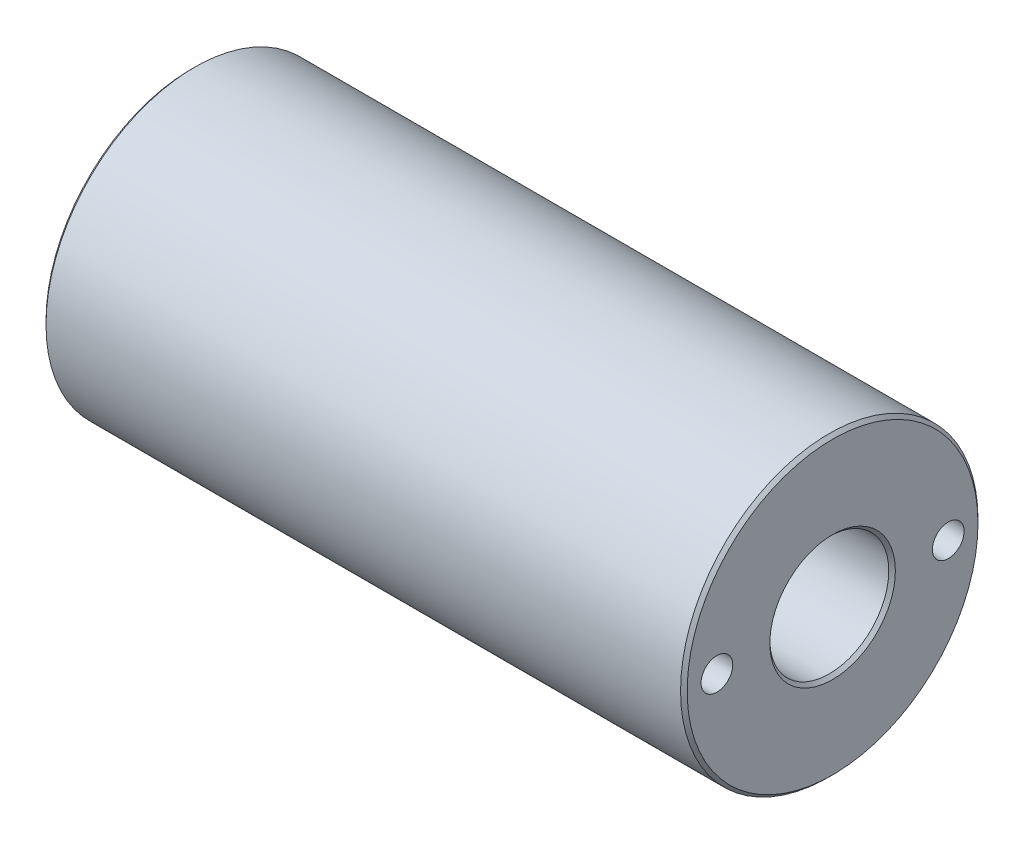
ISO-10303-21;
HEADER;
FILE_DESCRIPTION(('STEP AP214'),'2;1');
FILE_NAME('part.step','',(''),(''),'','','');
FILE_SCHEMA(('AUTOMOTIVE_DESIGN { 1 0 10303 214 1 1 1 1 }'));
ENDSEC;
DATA;
#1=APPLICATION_CONTEXT('core data for automotive mechanical design processes');
#2=APPLICATION_PROTOCOL_DEFINITION('international standard','automotive_design',2000,#1);
#3=PRODUCT_CONTEXT('',#1,'mechanical');
#4=PRODUCT('Part','Part','',(#3));
#5=PRODUCT_RELATED_PRODUCT_CATEGORY('part','',(#4));
#6=PRODUCT_DEFINITION_FORMATION('','',#4);
#7=PRODUCT_DEFINITION_CONTEXT('part definition',#1,'design');
#8=PRODUCT_DEFINITION('design','',#6,#7);
#9=PRODUCT_DEFINITION_SHAPE('','',#8);
#10=(LENGTH_UNIT() NAMED_UNIT(*) SI_UNIT(.MILLI.,.METRE.));
#11=(NAMED_UNIT(*) PLANE_ANGLE_UNIT() SI_UNIT($,.RADIAN.));
#12=(NAMED_UNIT(*) SI_UNIT($,.STERADIAN.) SOLID_ANGLE_UNIT());
#13=UNCERTAINTY_MEASURE_WITH_UNIT(LENGTH_MEASURE(1.E-05),#10,'distance_accuracy_value','');
#14=(GEOMETRIC_REPRESENTATION_CONTEXT(3) GLOBAL_UNCERTAINTY_ASSIGNED_CONTEXT((#13)) GLOBAL_UNIT_ASSIGNED_CONTEXT((#10,
#11,#12)) REPRESENTATION_CONTEXT('',''));
#15=CARTESIAN_POINT('',(0.,0.,0.));
#16=DIRECTION('',(0.,0.,1.));
#17=DIRECTION('',(1.,0.,0.));
#18=AXIS2_PLACEMENT_3D('',#15,#16,#17);
#19=CARTESIAN_POINT('',(446.537407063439,0.,0.));
#20=DIRECTION('',(1.,0.,0.));
#21=DIRECTION('',(0.,0.,-1.));
#22=AXIS2_PLACEMENT_3D('',#19,#20,#21);
#23=CYLINDRICAL_SURFACE('',#22,6.99999999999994);
#24=CARTESIAN_POINT('',(-17.5,0.,0.));
#25=DIRECTION('',(1.,0.,0.));
#26=DIRECTION('',(0.,0.,-1.));
#27=AXIS2_PLACEMENT_3D('',#24,#25,#26);
#28=CIRCLE('',#27,6.99999999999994);
#29=CARTESIAN_POINT('',(-17.5,0.,-6.99999999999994));
#30=VERTEX_POINT('',#29);
#31=EDGE_CURVE('E91',#30,#30,#28,.T.);
#32=ORIENTED_EDGE('',*,*,#31,.T.);
#33=EDGE_LOOP('',(#32));
#34=FACE_BOUND('',#33,.T.);
#35=CARTESIAN_POINT('',(-79.5,0.,0.));
#36=DIRECTION('',(-1.,0.,0.));
#37=DIRECTION('',(0.,0.,1.));
#38=AXIS2_PLACEMENT_3D('',#35,#36,#37);
#39=CIRCLE('',#38,6.99999999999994);
#40=CARTESIAN_POINT('',(-79.5,0.,6.99999999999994));
#41=VERTEX_POINT('',#40);
#42=EDGE_CURVE('E88',#41,#41,#39,.T.);
#43=ORIENTED_EDGE('',*,*,#42,.T.);
#44=EDGE_LOOP('',(#43));
#45=FACE_BOUND('',#44,.T.);
#46=ADVANCED_FACE('F30',(#34,#45),#23,.F.);
#47=CARTESIAN_POINT('',(-97.,6.99999999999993,0.));
#48=DIRECTION('',(-1.,0.,0.));
#49=DIRECTION('',(0.,0.,1.));
#50=AXIS2_PLACEMENT_3D('',#47,#48,#49);
#51=PLANE('',#50);
#52=CARTESIAN_POINT('',(-97.,0.,0.));
#53=DIRECTION('',(-1.,0.,0.));
#54=DIRECTION('',(0.,0.,1.));
#55=AXIS2_PLACEMENT_3D('',#52,#53,#54);
#56=CIRCLE('',#55,9.5);
#57=CARTESIAN_POINT('',(-97.,0.,9.5));
#58=VERTEX_POINT('',#57);
#59=EDGE_CURVE('E11',#58,#58,#56,.F.);
#60=ORIENTED_EDGE('',*,*,#59,.T.);
#61=EDGE_LOOP('',(#60));
#62=FACE_BOUND('',#61,.T.);
#63=CARTESIAN_POINT('',(-97.,0.,0.));
#64=DIRECTION('',(-1.,0.,0.));
#65=DIRECTION('',(0.,0.,1.));
#66=AXIS2_PLACEMENT_3D('',#63,#64,#65);
#67=CIRCLE('',#66,22.);
#68=CARTESIAN_POINT('',(-97.,0.,22.));
#69=VERTEX_POINT('',#68);
#70=EDGE_CURVE('E76',#69,#69,#67,.T.);
#71=ORIENTED_EDGE('',*,*,#70,.T.);
#72=EDGE_LOOP('',(#71));
#73=FACE_BOUND('',#72,.T.);
#74=ADVANCED_FACE('F32',(#62,#73),#51,.T.);
#75=CARTESIAN_POINT('',(446.537407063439,0.,0.));
#76=DIRECTION('',(1.,0.,0.));
#77=DIRECTION('',(0.,0.,-1.));
#78=AXIS2_PLACEMENT_3D('',#75,#76,#77);
#79=CYLINDRICAL_SURFACE('',#78,22.4999999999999);
#80=CARTESIAN_POINT('',(-96.5000000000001,0.,0.));
#81=DIRECTION('',(-1.,0.,0.));
#82=DIRECTION('',(0.,0.,1.));
#83=AXIS2_PLACEMENT_3D('',#80,#81,#82);
#84=CIRCLE('',#83,22.4999999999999);
#85=CARTESIAN_POINT('',(-96.5000000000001,0.,22.4999999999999));
#86=VERTEX_POINT('',#85);
#87=EDGE_CURVE('E73',#86,#86,#84,.F.);
#88=ORIENTED_EDGE('',*,*,#87,.T.);
#89=EDGE_LOOP('',(#88));
#90=FACE_BOUND('',#89,.T.);
#91=CARTESIAN_POINT('',(-0.500000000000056,0.,0.));
#92=DIRECTION('',(1.,0.,0.));
#93=DIRECTION('',(0.,0.,-1.));
#94=AXIS2_PLACEMENT_3D('',#91,#92,#93);
#95=CIRCLE('',#94,22.4999999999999);
#96=CARTESIAN_POINT('',(-0.500000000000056,0.,-22.4999999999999));
#97=VERTEX_POINT('',#96);
#98=EDGE_CURVE('E70',#97,#97,#95,.F.);
#99=ORIENTED_EDGE('',*,*,#98,.T.);
#100=EDGE_LOOP('',(#99));
#101=FACE_BOUND('',#100,.T.);
#102=ADVANCED_FACE('F123',(#90,#101),#79,.T.);
#103=CARTESIAN_POINT('',(0.,22.4999999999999,0.));
#104=DIRECTION('',(1.,0.,0.));
#105=DIRECTION('',(0.,0.,-1.));
#106=AXIS2_PLACEMENT_3D('',#103,#104,#105);
#107=PLANE('',#106);
#108=CARTESIAN_POINT('',(0.,0.,0.));
#109=DIRECTION('',(1.,0.,0.));
#110=DIRECTION('',(0.,0.,-1.));
#111=AXIS2_PLACEMENT_3D('',#108,#109,#110);
#112=CIRCLE('',#111,9.5);
#113=CARTESIAN_POINT('',(0.,0.,-9.5));
#114=VERTEX_POINT('',#113);
#115=EDGE_CURVE('E85',#114,#114,#112,.F.);
#116=ORIENTED_EDGE('',*,*,#115,.T.);
#117=EDGE_LOOP('',(#116));
#118=FACE_BOUND('',#117,.T.);
#119=CARTESIAN_POINT('',(0.,0.,17.5));
#120=DIRECTION('',(1.,0.,0.));
#121=DIRECTION('',(0.,0.,-1.));
#122=AXIS2_PLACEMENT_3D('',#119,#120,#121);
#123=CIRCLE('',#122,2.39999999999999);
#124=CARTESIAN_POINT('',(0.,0.,15.1));
#125=VERTEX_POINT('',#124);
#126=EDGE_CURVE('E54',#125,#125,#123,.T.);
#127=ORIENTED_EDGE('',*,*,#126,.F.);
#128=EDGE_LOOP('',(#127));
#129=FACE_BOUND('',#128,.T.);
#130=CARTESIAN_POINT('',(0.,0.,-17.5));
#131=DIRECTION('',(1.,0.,0.));
#132=DIRECTION('',(0.,0.,-1.));
#133=AXIS2_PLACEMENT_3D('',#130,#131,#132);
#134=CIRCLE('',#133,2.39999999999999);
#135=CARTESIAN_POINT('',(0.,0.,-19.9));
#136=VERTEX_POINT('',#135);
#137=EDGE_CURVE('E67',#136,#136,#134,.T.);
#138=ORIENTED_EDGE('',*,*,#137,.F.);
#139=EDGE_LOOP('',(#138));
#140=FACE_BOUND('',#139,.T.);
#141=CARTESIAN_POINT('',(0.,0.,0.));
#142=DIRECTION('',(1.,0.,0.));
#143=DIRECTION('',(0.,0.,-1.));
#144=AXIS2_PLACEMENT_3D('',#141,#142,#143);
#145=CIRCLE('',#144,21.9999999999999);
#146=CARTESIAN_POINT('',(0.,0.,-21.9999999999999));
#147=VERTEX_POINT('',#146);
#148=EDGE_CURVE('E79',#147,#147,#145,.T.);
#149=ORIENTED_EDGE('',*,*,#148,.T.);
#150=EDGE_LOOP('',(#149));
#151=FACE_BOUND('',#150,.T.);
#152=ADVANCED_FACE('F130',(#118,#129,#140,#151),#107,.T.);
#153=CARTESIAN_POINT('',(-96.5000000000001,0.,0.));
#154=DIRECTION('',(1.,0.,0.));
#155=DIRECTION('',(0.,0.,-1.));
#156=AXIS2_PLACEMENT_3D('',#153,#154,#155);
#157=CONICAL_SURFACE('',#156,22.4999999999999,0.785398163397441);
#158=ORIENTED_EDGE('',*,*,#70,.F.);
#159=EDGE_LOOP('',(#158));
#160=FACE_BOUND('',#159,.T.);
#161=ORIENTED_EDGE('',*,*,#87,.F.);
#162=EDGE_LOOP('',(#161));
#163=FACE_BOUND('',#162,.T.);
#164=ADVANCED_FACE('F128',(#160,#163),#157,.T.);
#165=CARTESIAN_POINT('',(0.,0.,0.));
#166=DIRECTION('',(-1.,0.,0.));
#167=DIRECTION('',(0.,0.,1.));
#168=AXIS2_PLACEMENT_3D('',#165,#166,#167);
#169=CONICAL_SURFACE('',#168,21.9999999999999,0.785398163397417);
#170=ORIENTED_EDGE('',*,*,#98,.F.);
#171=EDGE_LOOP('',(#170));
#172=FACE_BOUND('',#171,.T.);
#173=ORIENTED_EDGE('',*,*,#148,.F.);
#174=EDGE_LOOP('',(#173));
#175=FACE_BOUND('',#174,.T.);
#176=ADVANCED_FACE('F141',(#172,#175),#169,.T.);
#177=CARTESIAN_POINT('',(0.,0.,-17.5));
#178=DIRECTION('',(1.,0.,0.));
#179=DIRECTION('',(0.,0.,-1.));
#180=AXIS2_PLACEMENT_3D('',#177,#178,#179);
#181=CYLINDRICAL_SURFACE('',#180,2.39999999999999);
#182=CARTESIAN_POINT('',(-23.,0.,-17.5));
#183=DIRECTION('',(1.,0.,0.));
#184=DIRECTION('',(0.,0.,-1.));
#185=AXIS2_PLACEMENT_3D('',#182,#183,#184);
#186=CIRCLE('',#185,2.39999999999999);
#187=CARTESIAN_POINT('',(-23.,0.,-19.9));
#188=VERTEX_POINT('',#187);
#189=EDGE_CURVE('E58',#188,#188,#186,.T.);
#190=ORIENTED_EDGE('',*,*,#189,.F.);
#191=EDGE_LOOP('',(#190));
#192=FACE_BOUND('',#191,.T.);
#193=ORIENTED_EDGE('',*,*,#137,.T.);
#194=EDGE_LOOP('',(#193));
#195=FACE_BOUND('',#194,.T.);
#196=ADVANCED_FACE('F144',(#192,#195),#181,.F.);
#197=CARTESIAN_POINT('',(-23.,0.,-17.5));
#198=DIRECTION('',(1.,0.,0.));
#199=DIRECTION('',(0.,0.,-1.));
#200=AXIS2_PLACEMENT_3D('',#197,#198,#199);
#201=CONICAL_SURFACE('',#200,2.39999999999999,1.02974425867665);
#202=CARTESIAN_POINT('',(-24.4420654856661,0.,-17.5));
#203=VERTEX_POINT('',#202);
#204=VERTEX_LOOP('',#203);
#205=FACE_BOUND('',#204,.T.);
#206=ORIENTED_EDGE('',*,*,#189,.T.);
#207=EDGE_LOOP('',(#206));
#208=FACE_BOUND('',#207,.T.);
#209=ADVANCED_FACE('F151',(#205,#208),#201,.F.);
#210=CARTESIAN_POINT('',(0.,0.,17.5));
#211=DIRECTION('',(1.,0.,0.));
#212=DIRECTION('',(0.,0.,-1.));
#213=AXIS2_PLACEMENT_3D('',#210,#211,#212);
#214=CYLINDRICAL_SURFACE('',#213,2.39999999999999);
#215=CARTESIAN_POINT('',(-23.,0.,17.5));
#216=DIRECTION('',(1.,0.,0.));
#217=DIRECTION('',(0.,0.,-1.));
#218=AXIS2_PLACEMENT_3D('',#215,#216,#217);
#219=CIRCLE('',#218,2.39999999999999);
#220=CARTESIAN_POINT('',(-23.,0.,15.1));
#221=VERTEX_POINT('',#220);
#222=EDGE_CURVE('E52',#221,#221,#219,.T.);
#223=ORIENTED_EDGE('',*,*,#222,.F.);
#224=EDGE_LOOP('',(#223));
#225=FACE_BOUND('',#224,.T.);
#226=ORIENTED_EDGE('',*,*,#126,.T.);
#227=EDGE_LOOP('',(#226));
#228=FACE_BOUND('',#227,.T.);
#229=ADVANCED_FACE('F48',(#225,#228),#214,.F.);
#230=CARTESIAN_POINT('',(-23.,0.,17.5));
#231=DIRECTION('',(1.,0.,0.));
#232=DIRECTION('',(0.,0.,-1.));
#233=AXIS2_PLACEMENT_3D('',#230,#231,#232);
#234=CONICAL_SURFACE('',#233,2.39999999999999,1.02974425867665);
#235=CARTESIAN_POINT('',(-24.4420654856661,0.,17.5));
#236=VERTEX_POINT('',#235);
#237=VERTEX_LOOP('',#236);
#238=FACE_BOUND('',#237,.T.);
#239=ORIENTED_EDGE('',*,*,#222,.T.);
#240=EDGE_LOOP('',(#239));
#241=FACE_BOUND('',#240,.T.);
#242=ADVANCED_FACE('F44',(#238,#241),#234,.F.);
#243=CARTESIAN_POINT('',(-17.,0.,0.));
#244=DIRECTION('',(1.,0.,0.));
#245=DIRECTION('',(0.,0.,-1.));
#246=AXIS2_PLACEMENT_3D('',#243,#244,#245);
#247=CYLINDRICAL_SURFACE('',#246,9.);
#248=CARTESIAN_POINT('',(-0.5,0.,0.));
#249=DIRECTION('',(1.,0.,0.));
#250=DIRECTION('',(0.,0.,-1.));
#251=AXIS2_PLACEMENT_3D('',#248,#249,#250);
#252=CIRCLE('',#251,9.);
#253=CARTESIAN_POINT('',(-0.5,0.,-9.));
#254=VERTEX_POINT('',#253);
#255=EDGE_CURVE('E82',#254,#254,#252,.T.);
#256=ORIENTED_EDGE('',*,*,#255,.T.);
#257=EDGE_LOOP('',(#256));
#258=FACE_BOUND('',#257,.T.);
#259=CARTESIAN_POINT('',(-17.,0.,0.));
#260=DIRECTION('',(1.,0.,0.));
#261=DIRECTION('',(0.,0.,-1.));
#262=AXIS2_PLACEMENT_3D('',#259,#260,#261);
#263=CIRCLE('',#262,9.);
#264=CARTESIAN_POINT('',(-17.,0.,-9.));
#265=VERTEX_POINT('',#264);
#266=EDGE_CURVE('E55',#265,#265,#263,.T.);
#267=ORIENTED_EDGE('',*,*,#266,.F.);
#268=EDGE_LOOP('',(#267));
#269=FACE_BOUND('',#268,.T.);
#270=ADVANCED_FACE('F47',(#258,#269),#247,.F.);
#271=CARTESIAN_POINT('',(-17.,0.,0.));
#272=DIRECTION('',(1.,0.,0.));
#273=DIRECTION('',(0.,0.,-1.));
#274=AXIS2_PLACEMENT_3D('',#271,#272,#273);
#275=PLANE('',#274);
#276=CARTESIAN_POINT('',(-17.,0.,0.));
#277=DIRECTION('',(1.,0.,0.));
#278=DIRECTION('',(0.,0.,-1.));
#279=AXIS2_PLACEMENT_3D('',#276,#277,#278);
#280=CIRCLE('',#279,7.49999999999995);
#281=CARTESIAN_POINT('',(-17.,0.,-7.49999999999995));
#282=VERTEX_POINT('',#281);
#283=EDGE_CURVE('E94',#282,#282,#280,.F.);
#284=ORIENTED_EDGE('',*,*,#283,.T.);
#285=EDGE_LOOP('',(#284));
#286=FACE_BOUND('',#285,.T.);
#287=ORIENTED_EDGE('',*,*,#266,.T.);
#288=EDGE_LOOP('',(#287));
#289=FACE_BOUND('',#288,.T.);
#290=ADVANCED_FACE('F162',(#286,#289),#275,.T.);
#291=CARTESIAN_POINT('',(-80.,0.,0.));
#292=DIRECTION('',(-1.,0.,0.));
#293=DIRECTION('',(0.,0.,1.));
#294=AXIS2_PLACEMENT_3D('',#291,#292,#293);
#295=CYLINDRICAL_SURFACE('',#294,9.);
#296=CARTESIAN_POINT('',(-96.5,0.,0.));
#297=DIRECTION('',(-1.,0.,0.));
#298=DIRECTION('',(0.,0.,1.));
#299=AXIS2_PLACEMENT_3D('',#296,#297,#298);
#300=CIRCLE('',#299,9.);
#301=CARTESIAN_POINT('',(-96.5,0.,9.));
#302=VERTEX_POINT('',#301);
#303=EDGE_CURVE('E38',#302,#302,#300,.T.);
#304=ORIENTED_EDGE('',*,*,#303,.T.);
#305=EDGE_LOOP('',(#304));
#306=FACE_BOUND('',#305,.T.);
#307=CARTESIAN_POINT('',(-80.,0.,0.));
#308=DIRECTION('',(-1.,0.,0.));
#309=DIRECTION('',(0.,0.,1.));
#310=AXIS2_PLACEMENT_3D('',#307,#308,#309);
#311=CIRCLE('',#310,9.);
#312=CARTESIAN_POINT('',(-80.,0.,9.));
#313=VERTEX_POINT('',#312);
#314=EDGE_CURVE('E61',#313,#313,#311,.T.);
#315=ORIENTED_EDGE('',*,*,#314,.F.);
#316=EDGE_LOOP('',(#315));
#317=FACE_BOUND('',#316,.T.);
#318=ADVANCED_FACE('F102',(#306,#317),#295,.F.);
#319=CARTESIAN_POINT('',(-80.,0.,0.));
#320=DIRECTION('',(-1.,0.,0.));
#321=DIRECTION('',(0.,0.,1.));
#322=AXIS2_PLACEMENT_3D('',#319,#320,#321);
#323=PLANE('',#322);
#324=CARTESIAN_POINT('',(-80.,0.,0.));
#325=DIRECTION('',(-1.,0.,0.));
#326=DIRECTION('',(0.,0.,1.));
#327=AXIS2_PLACEMENT_3D('',#324,#325,#326);
#328=CIRCLE('',#327,7.49999999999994);
#329=CARTESIAN_POINT('',(-80.,0.,7.49999999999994));
#330=VERTEX_POINT('',#329);
#331=EDGE_CURVE('E97',#330,#330,#328,.F.);
#332=ORIENTED_EDGE('',*,*,#331,.T.);
#333=EDGE_LOOP('',(#332));
#334=FACE_BOUND('',#333,.T.);
#335=ORIENTED_EDGE('',*,*,#314,.T.);
#336=EDGE_LOOP('',(#335));
#337=FACE_BOUND('',#336,.T.);
#338=ADVANCED_FACE('F169',(#334,#337),#323,.T.);
#339=CARTESIAN_POINT('',(-0.5,0.,0.));
#340=DIRECTION('',(1.,0.,0.));
#341=DIRECTION('',(0.,0.,-1.));
#342=AXIS2_PLACEMENT_3D('',#339,#340,#341);
#343=CONICAL_SURFACE('',#342,9.,0.78539816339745);
#344=ORIENTED_EDGE('',*,*,#115,.F.);
#345=EDGE_LOOP('',(#344));
#346=FACE_BOUND('',#345,.T.);
#347=ORIENTED_EDGE('',*,*,#255,.F.);
#348=EDGE_LOOP('',(#347));
#349=FACE_BOUND('',#348,.T.);
#350=ADVANCED_FACE('F172',(#346,#349),#343,.F.);
#351=CARTESIAN_POINT('',(-17.5,0.,0.));
#352=DIRECTION('',(1.,0.,0.));
#353=DIRECTION('',(0.,0.,-1.));
#354=AXIS2_PLACEMENT_3D('',#351,#352,#353);
#355=CONICAL_SURFACE('',#354,6.99999999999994,0.785398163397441);
#356=ORIENTED_EDGE('',*,*,#283,.F.);
#357=EDGE_LOOP('',(#356));
#358=FACE_BOUND('',#357,.T.);
#359=ORIENTED_EDGE('',*,*,#31,.F.);
#360=EDGE_LOOP('',(#359));
#361=FACE_BOUND('',#360,.T.);
#362=ADVANCED_FACE('F113',(#358,#361),#355,.F.);
#363=CARTESIAN_POINT('',(-79.5,0.,0.));
#364=DIRECTION('',(-1.,0.,0.));
#365=DIRECTION('',(0.,0.,1.));
#366=AXIS2_PLACEMENT_3D('',#363,#364,#365);
#367=CONICAL_SURFACE('',#366,6.99999999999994,0.785398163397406);
#368=ORIENTED_EDGE('',*,*,#331,.F.);
#369=EDGE_LOOP('',(#368));
#370=FACE_BOUND('',#369,.T.);
#371=ORIENTED_EDGE('',*,*,#42,.F.);
#372=EDGE_LOOP('',(#371));
#373=FACE_BOUND('',#372,.T.);
#374=ADVANCED_FACE('F107',(#370,#373),#367,.F.);
#375=CARTESIAN_POINT('',(-96.5,0.,0.));
#376=DIRECTION('',(-1.,0.,0.));
#377=DIRECTION('',(0.,0.,1.));
#378=AXIS2_PLACEMENT_3D('',#375,#376,#377);
#379=CONICAL_SURFACE('',#378,9.,0.785398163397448);
#380=ORIENTED_EDGE('',*,*,#59,.F.);
#381=EDGE_LOOP('',(#380));
#382=FACE_BOUND('',#381,.T.);
#383=ORIENTED_EDGE('',*,*,#303,.F.);
#384=EDGE_LOOP('',(#383));
#385=FACE_BOUND('',#384,.T.);
#386=ADVANCED_FACE('F105',(#382,#385),#379,.F.);
#387=CLOSED_SHELL('',(#46,#74,#102,#152,#164,#176,#196,#209,#229,#242,#270,#290,#318,#338,#350,
#362,#374,#386));
#388=MANIFOLD_SOLID_BREP('B2',#387);
#389=ADVANCED_BREP_SHAPE_REPRESENTATION('',(#18,#388),#14);
#390=SHAPE_DEFINITION_REPRESENTATION(#9,#389);
ENDSEC;
END-ISO-10303-21;
